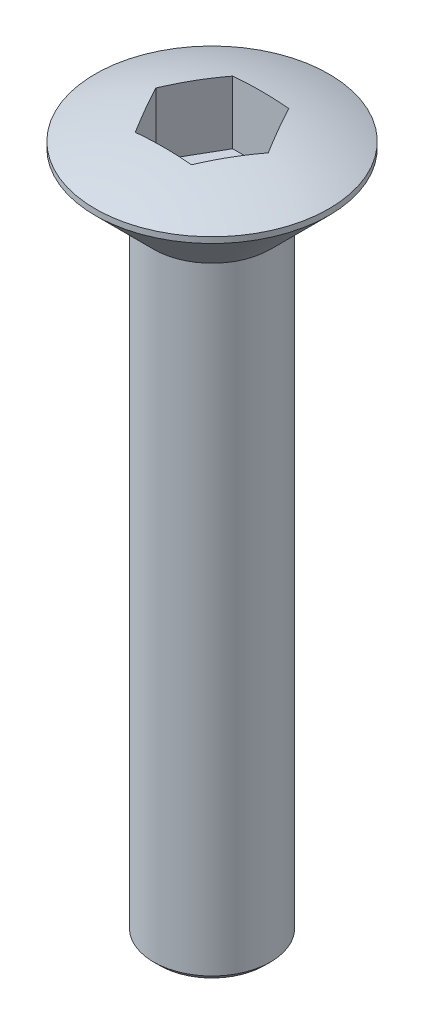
ISO-10303-21;
HEADER;
FILE_DESCRIPTION(('STEP AP214'),'2;1');
FILE_NAME('part.step','',(''),(''),'','','');
FILE_SCHEMA(('AUTOMOTIVE_DESIGN { 1 0 10303 214 1 1 1 1 }'));
ENDSEC;
DATA;
#1=APPLICATION_CONTEXT('core data for automotive mechanical design processes');
#2=APPLICATION_PROTOCOL_DEFINITION('international standard','automotive_design',2000,#1);
#3=PRODUCT_CONTEXT('',#1,'mechanical');
#4=PRODUCT('Part','Part','',(#3));
#5=PRODUCT_RELATED_PRODUCT_CATEGORY('part','',(#4));
#6=PRODUCT_DEFINITION_FORMATION('','',#4);
#7=PRODUCT_DEFINITION_CONTEXT('part definition',#1,'design');
#8=PRODUCT_DEFINITION('design','',#6,#7);
#9=PRODUCT_DEFINITION_SHAPE('','',#8);
#10=(LENGTH_UNIT() NAMED_UNIT(*) SI_UNIT(.MILLI.,.METRE.));
#11=(NAMED_UNIT(*) PLANE_ANGLE_UNIT() SI_UNIT($,.RADIAN.));
#12=(NAMED_UNIT(*) SI_UNIT($,.STERADIAN.) SOLID_ANGLE_UNIT());
#13=UNCERTAINTY_MEASURE_WITH_UNIT(LENGTH_MEASURE(1.E-05),#10,'distance_accuracy_value','');
#14=(GEOMETRIC_REPRESENTATION_CONTEXT(3) GLOBAL_UNCERTAINTY_ASSIGNED_CONTEXT((#13)) GLOBAL_UNIT_ASSIGNED_CONTEXT((#10,
#11,#12)) REPRESENTATION_CONTEXT('',''));
#15=CARTESIAN_POINT('',(0.,0.,0.));
#16=DIRECTION('',(0.,0.,1.));
#17=DIRECTION('',(1.,0.,0.));
#18=AXIS2_PLACEMENT_3D('',#15,#16,#17);
#19=CARTESIAN_POINT('',(0.,-14.1,0.));
#20=DIRECTION('',(0.,-1.,0.));
#21=DIRECTION('',(1.,0.,0.));
#22=AXIS2_PLACEMENT_3D('',#19,#20,#21);
#23=SPHERICAL_SURFACE('',#22,15.6);
#24=CARTESIAN_POINT('',(0.,0.300000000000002,0.));
#25=DIRECTION('',(0.,-1.,0.));
#26=DIRECTION('',(1.,0.,0.));
#27=AXIS2_PLACEMENT_3D('',#24,#25,#26);
#28=CIRCLE('',#27,6.);
#29=CARTESIAN_POINT('',(6.,0.300000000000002,0.));
#30=VERTEX_POINT('',#29);
#31=EDGE_CURVE('E161',#30,#30,#28,.T.);
#32=ORIENTED_EDGE('',*,*,#31,.F.);
#33=EDGE_LOOP('',(#32));
#34=FACE_BOUND('',#33,.T.);
#35=CARTESIAN_POINT('',(0.,-14.1,2.5));
#36=DIRECTION('',(0.,0.,-1.));
#37=DIRECTION('',(-1.,0.,0.));
#38=AXIS2_PLACEMENT_3D('',#35,#36,#37);
#39=CIRCLE('',#38,15.3983765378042);
#40=CARTESIAN_POINT('',(1.44337567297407,1.23057946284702,2.5));
#41=VERTEX_POINT('',#40);
#42=CARTESIAN_POINT('',(-1.44337567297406,1.23057946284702,2.5));
#43=VERTEX_POINT('',#42);
#44=EDGE_CURVE('E51',#41,#43,#39,.F.);
#45=ORIENTED_EDGE('',*,*,#44,.T.);
#46=CARTESIAN_POINT('',(-2.1650635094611,-14.1,1.25));
#47=DIRECTION('',(0.866025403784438,0.,-0.5));
#48=DIRECTION('',(-0.5,0.,-0.866025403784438));
#49=AXIS2_PLACEMENT_3D('',#46,#47,#48);
#50=CIRCLE('',#49,15.3983765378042);
#51=CARTESIAN_POINT('',(-2.88675134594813,1.23057946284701,0.));
#52=VERTEX_POINT('',#51);
#53=EDGE_CURVE('E11',#43,#52,#50,.F.);
#54=ORIENTED_EDGE('',*,*,#53,.T.);
#55=CARTESIAN_POINT('',(-2.1650635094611,-14.1,-1.25));
#56=DIRECTION('',(0.866025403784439,0.,0.5));
#57=DIRECTION('',(0.5,0.,-0.866025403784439));
#58=AXIS2_PLACEMENT_3D('',#55,#56,#57);
#59=CIRCLE('',#58,15.3983765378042);
#60=CARTESIAN_POINT('',(-1.44337567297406,1.23057946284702,-2.5));
#61=VERTEX_POINT('',#60);
#62=EDGE_CURVE('E165',#52,#61,#59,.F.);
#63=ORIENTED_EDGE('',*,*,#62,.T.);
#64=CARTESIAN_POINT('',(0.,-14.1,-2.5));
#65=DIRECTION('',(0.,0.,1.));
#66=DIRECTION('',(1.,0.,0.));
#67=AXIS2_PLACEMENT_3D('',#64,#65,#66);
#68=CIRCLE('',#67,15.3983765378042);
#69=CARTESIAN_POINT('',(1.44337567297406,1.23057946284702,-2.5));
#70=VERTEX_POINT('',#69);
#71=EDGE_CURVE('E169',#61,#70,#68,.F.);
#72=ORIENTED_EDGE('',*,*,#71,.T.);
#73=CARTESIAN_POINT('',(2.1650635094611,-14.1,-1.25));
#74=DIRECTION('',(-0.866025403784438,0.,0.500000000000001));
#75=DIRECTION('',(0.500000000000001,0.,0.866025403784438));
#76=AXIS2_PLACEMENT_3D('',#73,#74,#75);
#77=CIRCLE('',#76,15.3983765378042);
#78=CARTESIAN_POINT('',(2.88675134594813,1.23057946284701,0.));
#79=VERTEX_POINT('',#78);
#80=EDGE_CURVE('E173',#70,#79,#77,.F.);
#81=ORIENTED_EDGE('',*,*,#80,.T.);
#82=CARTESIAN_POINT('',(2.1650635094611,-14.1,1.25));
#83=DIRECTION('',(-0.866025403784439,0.,-0.5));
#84=DIRECTION('',(-0.5,0.,0.866025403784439));
#85=AXIS2_PLACEMENT_3D('',#82,#83,#84);
#86=CIRCLE('',#85,15.3983765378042);
#87=EDGE_CURVE('E177',#79,#41,#86,.F.);
#88=ORIENTED_EDGE('',*,*,#87,.T.);
#89=EDGE_LOOP('',(#45,#54,#63,#72,#81,#88));
#90=FACE_BOUND('',#89,.T.);
#91=ADVANCED_FACE('F42',(#34,#90),#23,.T.);
#92=CARTESIAN_POINT('',(0.,-35.,0.));
#93=DIRECTION('',(0.,-1.,0.));
#94=DIRECTION('',(1.,0.,0.));
#95=AXIS2_PLACEMENT_3D('',#92,#93,#94);
#96=PLANE('',#95);
#97=CARTESIAN_POINT('',(0.,-35.,0.));
#98=DIRECTION('',(0.,-1.,0.));
#99=DIRECTION('',(1.,0.,0.));
#100=AXIS2_PLACEMENT_3D('',#97,#98,#99);
#101=CIRCLE('',#100,2.7);
#102=CARTESIAN_POINT('',(2.7,-35.,0.));
#103=VERTEX_POINT('',#102);
#104=EDGE_CURVE('E102',#103,#103,#101,.T.);
#105=ORIENTED_EDGE('',*,*,#104,.T.);
#106=EDGE_LOOP('',(#105));
#107=FACE_BOUND('',#106,.T.);
#108=ADVANCED_FACE('F44',(#107),#96,.T.);
#109=CARTESIAN_POINT('',(0.,-35.,0.));
#110=DIRECTION('',(0.,-1.,0.));
#111=DIRECTION('',(1.,0.,0.));
#112=AXIS2_PLACEMENT_3D('',#109,#110,#111);
#113=CYLINDRICAL_SURFACE('',#112,6.);
#114=ORIENTED_EDGE('',*,*,#31,.T.);
#115=EDGE_LOOP('',(#114));
#116=FACE_BOUND('',#115,.T.);
#117=CARTESIAN_POINT('',(0.,0.,0.));
#118=DIRECTION('',(0.,-1.,0.));
#119=DIRECTION('',(1.,0.,0.));
#120=AXIS2_PLACEMENT_3D('',#117,#118,#119);
#121=CIRCLE('',#120,6.);
#122=CARTESIAN_POINT('',(6.,0.,0.));
#123=VERTEX_POINT('',#122);
#124=EDGE_CURVE('E157',#123,#123,#121,.T.);
#125=ORIENTED_EDGE('',*,*,#124,.F.);
#126=EDGE_LOOP('',(#125));
#127=FACE_BOUND('',#126,.T.);
#128=ADVANCED_FACE('F207',(#116,#127),#113,.T.);
#129=CARTESIAN_POINT('',(0.,-2.99999999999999,0.));
#130=DIRECTION('',(0.,1.,0.));
#131=DIRECTION('',(-1.,0.,0.));
#132=AXIS2_PLACEMENT_3D('',#129,#130,#131);
#133=CONICAL_SURFACE('',#132,3.,0.78539816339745);
#134=ORIENTED_EDGE('',*,*,#124,.T.);
#135=EDGE_LOOP('',(#134));
#136=FACE_BOUND('',#135,.T.);
#137=CARTESIAN_POINT('',(0.,-2.99999999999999,0.));
#138=DIRECTION('',(0.,-1.,0.));
#139=DIRECTION('',(1.,0.,0.));
#140=AXIS2_PLACEMENT_3D('',#137,#138,#139);
#141=CIRCLE('',#140,3.);
#142=CARTESIAN_POINT('',(3.,-2.99999999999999,0.));
#143=VERTEX_POINT('',#142);
#144=EDGE_CURVE('E153',#143,#143,#141,.T.);
#145=ORIENTED_EDGE('',*,*,#144,.F.);
#146=EDGE_LOOP('',(#145));
#147=FACE_BOUND('',#146,.T.);
#148=ADVANCED_FACE('F213',(#136,#147),#133,.T.);
#149=CARTESIAN_POINT('',(0.,-35.,0.));
#150=DIRECTION('',(0.,-1.,0.));
#151=DIRECTION('',(1.,0.,0.));
#152=AXIS2_PLACEMENT_3D('',#149,#150,#151);
#153=CYLINDRICAL_SURFACE('',#152,3.);
#154=ORIENTED_EDGE('',*,*,#144,.T.);
#155=EDGE_LOOP('',(#154));
#156=FACE_BOUND('',#155,.T.);
#157=CARTESIAN_POINT('',(0.,-34.7,0.));
#158=DIRECTION('',(0.,-1.,0.));
#159=DIRECTION('',(1.,0.,0.));
#160=AXIS2_PLACEMENT_3D('',#157,#158,#159);
#161=CIRCLE('',#160,3.);
#162=CARTESIAN_POINT('',(3.,-34.7,0.));
#163=VERTEX_POINT('',#162);
#164=EDGE_CURVE('E149',#163,#163,#161,.T.);
#165=ORIENTED_EDGE('',*,*,#164,.F.);
#166=EDGE_LOOP('',(#165));
#167=FACE_BOUND('',#166,.T.);
#168=ADVANCED_FACE('F217',(#156,#167),#153,.T.);
#169=CARTESIAN_POINT('',(0.,-35.,0.));
#170=DIRECTION('',(0.,1.,0.));
#171=DIRECTION('',(-1.,0.,0.));
#172=AXIS2_PLACEMENT_3D('',#169,#170,#171);
#173=CONICAL_SURFACE('',#172,2.7,0.785398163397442);
#174=ORIENTED_EDGE('',*,*,#164,.T.);
#175=EDGE_LOOP('',(#174));
#176=FACE_BOUND('',#175,.T.);
#177=ORIENTED_EDGE('',*,*,#104,.F.);
#178=EDGE_LOOP('',(#177));
#179=FACE_BOUND('',#178,.T.);
#180=ADVANCED_FACE('F221',(#176,#179),#173,.T.);
#181=CARTESIAN_POINT('',(-2.88675134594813,1.5,0.));
#182=DIRECTION('',(0.866025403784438,0.,-0.5));
#183=DIRECTION('',(-0.5,0.,-0.866025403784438));
#184=AXIS2_PLACEMENT_3D('',#181,#182,#183);
#185=PLANE('',#184);
#186=DIRECTION('',(0.,-1.,0.));
#187=VECTOR('',#186,1.);
#188=CARTESIAN_POINT('',(-1.44337567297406,1.5,2.5));
#189=LINE('',#188,#187);
#190=CARTESIAN_POINT('',(-1.44337567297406,-2.,2.5));
#191=VERTEX_POINT('',#190);
#192=EDGE_CURVE('E93',#43,#191,#189,.T.);
#193=ORIENTED_EDGE('',*,*,#192,.T.);
#194=DIRECTION('',(0.5,0.,0.866025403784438));
#195=VECTOR('',#194,1.);
#196=CARTESIAN_POINT('',(-2.88675134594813,-2.,0.));
#197=LINE('',#196,#195);
#198=CARTESIAN_POINT('',(-2.88675134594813,-2.,0.));
#199=VERTEX_POINT('',#198);
#200=EDGE_CURVE('E97',#199,#191,#197,.T.);
#201=ORIENTED_EDGE('',*,*,#200,.F.);
#202=DIRECTION('',(0.,-1.,0.));
#203=VECTOR('',#202,1.);
#204=CARTESIAN_POINT('',(-2.88675134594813,1.5,0.));
#205=LINE('',#204,#203);
#206=EDGE_CURVE('E133',#52,#199,#205,.T.);
#207=ORIENTED_EDGE('',*,*,#206,.F.);
#208=ORIENTED_EDGE('',*,*,#53,.F.);
#209=EDGE_LOOP('',(#193,#201,#207,#208));
#210=FACE_BOUND('',#209,.T.);
#211=ADVANCED_FACE('F95',(#210),#185,.T.);
#212=CARTESIAN_POINT('',(-1.44337567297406,1.5,2.5));
#213=DIRECTION('',(0.,0.,-1.));
#214=DIRECTION('',(-1.,0.,0.));
#215=AXIS2_PLACEMENT_3D('',#212,#213,#214);
#216=PLANE('',#215);
#217=DIRECTION('',(0.,-1.,0.));
#218=VECTOR('',#217,1.);
#219=CARTESIAN_POINT('',(1.44337567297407,1.5,2.5));
#220=LINE('',#219,#218);
#221=CARTESIAN_POINT('',(1.44337567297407,-2.,2.5));
#222=VERTEX_POINT('',#221);
#223=EDGE_CURVE('E103',#41,#222,#220,.T.);
#224=ORIENTED_EDGE('',*,*,#223,.T.);
#225=DIRECTION('',(1.,0.,0.));
#226=VECTOR('',#225,1.);
#227=CARTESIAN_POINT('',(-1.44337567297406,-2.,2.5));
#228=LINE('',#227,#226);
#229=EDGE_CURVE('E106',#191,#222,#228,.T.);
#230=ORIENTED_EDGE('',*,*,#229,.F.);
#231=ORIENTED_EDGE('',*,*,#192,.F.);
#232=ORIENTED_EDGE('',*,*,#44,.F.);
#233=EDGE_LOOP('',(#224,#230,#231,#232));
#234=FACE_BOUND('',#233,.T.);
#235=ADVANCED_FACE('F107',(#234),#216,.T.);
#236=CARTESIAN_POINT('',(1.44337567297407,1.5,2.5));
#237=DIRECTION('',(-0.866025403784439,0.,-0.5));
#238=DIRECTION('',(-0.5,0.,0.866025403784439));
#239=AXIS2_PLACEMENT_3D('',#236,#237,#238);
#240=PLANE('',#239);
#241=DIRECTION('',(0.,-1.,0.));
#242=VECTOR('',#241,1.);
#243=CARTESIAN_POINT('',(2.88675134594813,1.5,0.));
#244=LINE('',#243,#242);
#245=CARTESIAN_POINT('',(2.88675134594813,-2.,0.));
#246=VERTEX_POINT('',#245);
#247=EDGE_CURVE('E141',#79,#246,#244,.T.);
#248=ORIENTED_EDGE('',*,*,#247,.T.);
#249=DIRECTION('',(0.5,0.,-0.866025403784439));
#250=VECTOR('',#249,1.);
#251=CARTESIAN_POINT('',(1.44337567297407,-2.,2.5));
#252=LINE('',#251,#250);
#253=EDGE_CURVE('E113',#222,#246,#252,.T.);
#254=ORIENTED_EDGE('',*,*,#253,.F.);
#255=ORIENTED_EDGE('',*,*,#223,.F.);
#256=ORIENTED_EDGE('',*,*,#87,.F.);
#257=EDGE_LOOP('',(#248,#254,#255,#256));
#258=FACE_BOUND('',#257,.T.);
#259=ADVANCED_FACE('F184',(#258),#240,.T.);
#260=CARTESIAN_POINT('',(2.88675134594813,1.5,0.));
#261=DIRECTION('',(-0.866025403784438,0.,0.500000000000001));
#262=DIRECTION('',(0.500000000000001,0.,0.866025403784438));
#263=AXIS2_PLACEMENT_3D('',#260,#261,#262);
#264=PLANE('',#263);
#265=DIRECTION('',(0.,-1.,0.));
#266=VECTOR('',#265,1.);
#267=CARTESIAN_POINT('',(1.44337567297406,1.5,-2.5));
#268=LINE('',#267,#266);
#269=CARTESIAN_POINT('',(1.44337567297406,-2.,-2.5));
#270=VERTEX_POINT('',#269);
#271=EDGE_CURVE('E138',#70,#270,#268,.T.);
#272=ORIENTED_EDGE('',*,*,#271,.T.);
#273=DIRECTION('',(-0.500000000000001,0.,-0.866025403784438));
#274=VECTOR('',#273,1.);
#275=CARTESIAN_POINT('',(2.88675134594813,-2.,0.));
#276=LINE('',#275,#274);
#277=EDGE_CURVE('E124',#246,#270,#276,.T.);
#278=ORIENTED_EDGE('',*,*,#277,.F.);
#279=ORIENTED_EDGE('',*,*,#247,.F.);
#280=ORIENTED_EDGE('',*,*,#80,.F.);
#281=EDGE_LOOP('',(#272,#278,#279,#280));
#282=FACE_BOUND('',#281,.T.);
#283=ADVANCED_FACE('F189',(#282),#264,.T.);
#284=CARTESIAN_POINT('',(1.44337567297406,1.5,-2.5));
#285=DIRECTION('',(0.,0.,1.));
#286=DIRECTION('',(1.,0.,0.));
#287=AXIS2_PLACEMENT_3D('',#284,#285,#286);
#288=PLANE('',#287);
#289=DIRECTION('',(0.,-1.,0.));
#290=VECTOR('',#289,1.);
#291=CARTESIAN_POINT('',(-1.44337567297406,1.5,-2.5));
#292=LINE('',#291,#290);
#293=CARTESIAN_POINT('',(-1.44337567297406,-2.,-2.5));
#294=VERTEX_POINT('',#293);
#295=EDGE_CURVE('E58',#61,#294,#292,.T.);
#296=ORIENTED_EDGE('',*,*,#295,.T.);
#297=DIRECTION('',(-1.,0.,0.));
#298=VECTOR('',#297,1.);
#299=CARTESIAN_POINT('',(1.44337567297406,-2.,-2.5));
#300=LINE('',#299,#298);
#301=EDGE_CURVE('E128',#270,#294,#300,.T.);
#302=ORIENTED_EDGE('',*,*,#301,.F.);
#303=ORIENTED_EDGE('',*,*,#271,.F.);
#304=ORIENTED_EDGE('',*,*,#71,.F.);
#305=EDGE_LOOP('',(#296,#302,#303,#304));
#306=FACE_BOUND('',#305,.T.);
#307=ADVANCED_FACE('F192',(#306),#288,.T.);
#308=CARTESIAN_POINT('',(-1.44337567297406,1.5,-2.5));
#309=DIRECTION('',(0.866025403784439,0.,0.5));
#310=DIRECTION('',(0.5,0.,-0.866025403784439));
#311=AXIS2_PLACEMENT_3D('',#308,#309,#310);
#312=PLANE('',#311);
#313=ORIENTED_EDGE('',*,*,#206,.T.);
#314=DIRECTION('',(-0.5,0.,0.866025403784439));
#315=VECTOR('',#314,1.);
#316=CARTESIAN_POINT('',(-1.44337567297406,-2.,-2.5));
#317=LINE('',#316,#315);
#318=EDGE_CURVE('E117',#294,#199,#317,.T.);
#319=ORIENTED_EDGE('',*,*,#318,.F.);
#320=ORIENTED_EDGE('',*,*,#295,.F.);
#321=ORIENTED_EDGE('',*,*,#62,.F.);
#322=EDGE_LOOP('',(#313,#319,#320,#321));
#323=FACE_BOUND('',#322,.T.);
#324=ADVANCED_FACE('F193',(#323),#312,.T.);
#325=CARTESIAN_POINT('',(0.,-2.,0.));
#326=DIRECTION('',(0.,1.,0.));
#327=DIRECTION('',(0.,0.,1.));
#328=AXIS2_PLACEMENT_3D('',#325,#326,#327);
#329=PLANE('',#328);
#330=ORIENTED_EDGE('',*,*,#200,.T.);
#331=ORIENTED_EDGE('',*,*,#229,.T.);
#332=ORIENTED_EDGE('',*,*,#253,.T.);
#333=ORIENTED_EDGE('',*,*,#277,.T.);
#334=ORIENTED_EDGE('',*,*,#301,.T.);
#335=ORIENTED_EDGE('',*,*,#318,.T.);
#336=EDGE_LOOP('',(#330,#331,#332,#333,#334,#335));
#337=FACE_BOUND('',#336,.T.);
#338=ADVANCED_FACE('F115',(#337),#329,.T.);
#339=CLOSED_SHELL('',(#91,#108,#128,#148,#168,#180,#211,#235,#259,#283,#307,#324,#338));
#340=MANIFOLD_SOLID_BREP('B2',#339);
#341=ADVANCED_BREP_SHAPE_REPRESENTATION('',(#18,#340),#14);
#342=SHAPE_DEFINITION_REPRESENTATION(#9,#341);
ENDSEC;
END-ISO-10303-21;
